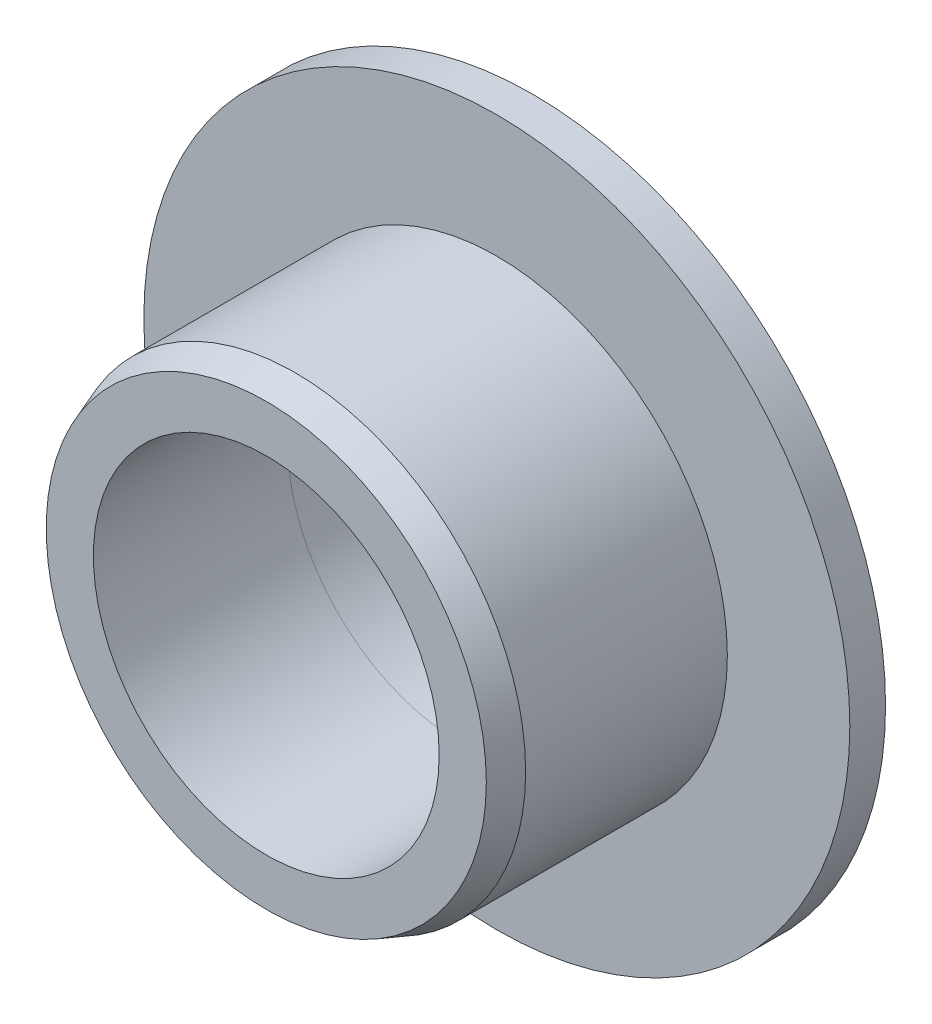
ISO-10303-21;
HEADER;
FILE_DESCRIPTION(('STEP AP214'),'2;1');
FILE_NAME('part.step','',(''),(''),'','','');
FILE_SCHEMA(('AUTOMOTIVE_DESIGN { 1 0 10303 214 1 1 1 1 }'));
ENDSEC;
DATA;
#1=APPLICATION_CONTEXT('core data for automotive mechanical design processes');
#2=APPLICATION_PROTOCOL_DEFINITION('international standard','automotive_design',2000,#1);
#3=PRODUCT_CONTEXT('',#1,'mechanical');
#4=PRODUCT('Part','Part','',(#3));
#5=PRODUCT_RELATED_PRODUCT_CATEGORY('part','',(#4));
#6=PRODUCT_DEFINITION_FORMATION('','',#4);
#7=PRODUCT_DEFINITION_CONTEXT('part definition',#1,'design');
#8=PRODUCT_DEFINITION('design','',#6,#7);
#9=PRODUCT_DEFINITION_SHAPE('','',#8);
#10=(LENGTH_UNIT() NAMED_UNIT(*) SI_UNIT(.MILLI.,.METRE.));
#11=(NAMED_UNIT(*) PLANE_ANGLE_UNIT() SI_UNIT($,.RADIAN.));
#12=(NAMED_UNIT(*) SI_UNIT($,.STERADIAN.) SOLID_ANGLE_UNIT());
#13=UNCERTAINTY_MEASURE_WITH_UNIT(LENGTH_MEASURE(1.E-05),#10,'distance_accuracy_value','');
#14=(GEOMETRIC_REPRESENTATION_CONTEXT(3) GLOBAL_UNCERTAINTY_ASSIGNED_CONTEXT((#13)) GLOBAL_UNIT_ASSIGNED_CONTEXT((#10,
#11,#12)) REPRESENTATION_CONTEXT('',''));
#15=CARTESIAN_POINT('',(0.,0.,0.));
#16=DIRECTION('',(0.,0.,1.));
#17=DIRECTION('',(1.,0.,0.));
#18=AXIS2_PLACEMENT_3D('',#15,#16,#17);
#19=CARTESIAN_POINT('',(-4.44089209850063E-13,2.70616862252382E-13,-2.22044604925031E-13));
#20=DIRECTION('',(0.,0.,1.));
#21=DIRECTION('',(1.,0.,0.));
#22=AXIS2_PLACEMENT_3D('',#19,#20,#21);
#23=CYLINDRICAL_SURFACE('',#22,12.);
#24=CARTESIAN_POINT('',(-1.55431223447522E-12,0.,18.4800000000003));
#25=DIRECTION('',(0.,0.,1.));
#26=DIRECTION('',(1.,0.,0.));
#27=AXIS2_PLACEMENT_3D('',#24,#25,#26);
#28=CIRCLE('',#27,12.);
#29=CARTESIAN_POINT('',(11.9999999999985,0.,18.4800000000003));
#30=VERTEX_POINT('',#29);
#31=EDGE_CURVE('E52',#30,#30,#28,.T.);
#32=ORIENTED_EDGE('',*,*,#31,.T.);
#33=EDGE_LOOP('',(#32));
#34=FACE_BOUND('',#33,.T.);
#35=CARTESIAN_POINT('',(-4.44089209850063E-13,-1.52655665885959E-13,5.00000000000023));
#36=DIRECTION('',(0.,0.,-1.));
#37=DIRECTION('',(-1.,0.,0.));
#38=AXIS2_PLACEMENT_3D('',#35,#36,#37);
#39=CIRCLE('',#38,12.);
#40=CARTESIAN_POINT('',(-12.0000000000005,-1.53488333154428E-13,5.00000000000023));
#41=VERTEX_POINT('',#40);
#42=EDGE_CURVE('E34',#41,#41,#39,.F.);
#43=ORIENTED_EDGE('',*,*,#42,.F.);
#44=EDGE_LOOP('',(#43));
#45=FACE_BOUND('',#44,.T.);
#46=ADVANCED_FACE('F30',(#34,#45),#23,.F.);
#47=CARTESIAN_POINT('',(-4.44089209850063E-13,-1.04083408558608E-13,2.48000000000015));
#48=DIRECTION('',(0.,0.,1.));
#49=DIRECTION('',(1.,0.,0.));
#50=AXIS2_PLACEMENT_3D('',#47,#48,#49);
#51=PLANE('',#50);
#52=CARTESIAN_POINT('',(-4.44089209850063E-13,-1.04083408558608E-13,2.48000000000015));
#53=DIRECTION('',(0.,0.,1.));
#54=DIRECTION('',(1.,0.,0.));
#55=AXIS2_PLACEMENT_3D('',#52,#53,#54);
#56=CIRCLE('',#55,24.5);
#57=CARTESIAN_POINT('',(24.4999999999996,-1.02383379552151E-13,2.48000000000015));
#58=VERTEX_POINT('',#57);
#59=EDGE_CURVE('E64',#58,#58,#56,.T.);
#60=ORIENTED_EDGE('',*,*,#59,.T.);
#61=EDGE_LOOP('',(#60));
#62=FACE_BOUND('',#61,.T.);
#63=CARTESIAN_POINT('',(-4.44089209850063E-13,-1.04083408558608E-13,2.48000000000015));
#64=DIRECTION('',(0.,0.,1.));
#65=DIRECTION('',(1.,0.,0.));
#66=AXIS2_PLACEMENT_3D('',#63,#64,#65);
#67=CIRCLE('',#66,16.);
#68=CARTESIAN_POINT('',(15.9999999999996,-1.02973185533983E-13,2.48000000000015));
#69=VERTEX_POINT('',#68);
#70=EDGE_CURVE('E60',#69,#69,#67,.T.);
#71=ORIENTED_EDGE('',*,*,#70,.F.);
#72=EDGE_LOOP('',(#71));
#73=FACE_BOUND('',#72,.T.);
#74=ADVANCED_FACE('F88',(#62,#73),#51,.T.);
#75=CARTESIAN_POINT('',(-4.44089209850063E-13,-1.04083408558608E-13,2.48000000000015));
#76=DIRECTION('',(0.,0.,-1.));
#77=DIRECTION('',(-1.,0.,0.));
#78=AXIS2_PLACEMENT_3D('',#75,#76,#77);
#79=CYLINDRICAL_SURFACE('',#78,24.5);
#80=ORIENTED_EDGE('',*,*,#59,.F.);
#81=EDGE_LOOP('',(#80));
#82=FACE_BOUND('',#81,.T.);
#83=CARTESIAN_POINT('',(-4.44089209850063E-13,2.70616862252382E-13,-2.22044604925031E-13));
#84=DIRECTION('',(0.,0.,1.));
#85=DIRECTION('',(1.,0.,0.));
#86=AXIS2_PLACEMENT_3D('',#83,#84,#85);
#87=CIRCLE('',#86,24.5);
#88=CARTESIAN_POINT('',(24.4999999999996,2.72316891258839E-13,-2.22044604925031E-13));
#89=VERTEX_POINT('',#88);
#90=EDGE_CURVE('E63',#89,#89,#87,.T.);
#91=ORIENTED_EDGE('',*,*,#90,.T.);
#92=EDGE_LOOP('',(#91));
#93=FACE_BOUND('',#92,.T.);
#94=ADVANCED_FACE('F94',(#82,#93),#79,.T.);
#95=CARTESIAN_POINT('',(-4.44089209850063E-13,2.70616862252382E-13,-2.22044604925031E-13));
#96=DIRECTION('',(0.,0.,1.));
#97=DIRECTION('',(1.,0.,0.));
#98=AXIS2_PLACEMENT_3D('',#95,#96,#97);
#99=PLANE('',#98);
#100=CARTESIAN_POINT('',(-4.44089209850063E-13,2.70616862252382E-13,-2.22044604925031E-13));
#101=DIRECTION('',(0.,0.,1.));
#102=DIRECTION('',(1.,0.,0.));
#103=AXIS2_PLACEMENT_3D('',#100,#101,#102);
#104=CIRCLE('',#103,12.5);
#105=CARTESIAN_POINT('',(12.4999999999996,2.7148422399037E-13,-2.22044604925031E-13));
#106=VERTEX_POINT('',#105);
#107=EDGE_CURVE('E10',#106,#106,#104,.T.);
#108=ORIENTED_EDGE('',*,*,#107,.T.);
#109=EDGE_LOOP('',(#108));
#110=FACE_BOUND('',#109,.T.);
#111=ORIENTED_EDGE('',*,*,#90,.F.);
#112=EDGE_LOOP('',(#111));
#113=FACE_BOUND('',#112,.T.);
#114=ADVANCED_FACE('F103',(#110,#113),#99,.F.);
#115=CARTESIAN_POINT('',(-1.55431223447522E-12,0.,18.4800000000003));
#116=DIRECTION('',(0.,0.,-1.));
#117=DIRECTION('',(-1.,0.,0.));
#118=AXIS2_PLACEMENT_3D('',#115,#116,#117);
#119=CYLINDRICAL_SURFACE('',#118,16.);
#120=CARTESIAN_POINT('',(-6.66133814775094E-13,-1.66533453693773E-13,16.4800000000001));
#121=DIRECTION('',(0.,0.,1.));
#122=DIRECTION('',(1.,0.,0.));
#123=AXIS2_PLACEMENT_3D('',#120,#121,#122);
#124=CIRCLE('',#123,16.);
#125=CARTESIAN_POINT('',(15.9999999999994,-1.65423230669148E-13,16.4800000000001));
#126=VERTEX_POINT('',#125);
#127=EDGE_CURVE('E38',#126,#126,#124,.F.);
#128=ORIENTED_EDGE('',*,*,#127,.T.);
#129=EDGE_LOOP('',(#128));
#130=FACE_BOUND('',#129,.T.);
#131=ORIENTED_EDGE('',*,*,#70,.T.);
#132=EDGE_LOOP('',(#131));
#133=FACE_BOUND('',#132,.T.);
#134=ADVANCED_FACE('F82',(#130,#133),#119,.T.);
#135=CARTESIAN_POINT('',(-1.55431223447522E-12,0.,18.4800000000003));
#136=DIRECTION('',(0.,0.,1.));
#137=DIRECTION('',(1.,0.,0.));
#138=AXIS2_PLACEMENT_3D('',#135,#136,#137);
#139=PLANE('',#138);
#140=ORIENTED_EDGE('',*,*,#31,.F.);
#141=EDGE_LOOP('',(#140));
#142=FACE_BOUND('',#141,.T.);
#143=CARTESIAN_POINT('',(-1.55431223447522E-12,0.,18.4800000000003));
#144=DIRECTION('',(0.,0.,1.));
#145=DIRECTION('',(1.,0.,0.));
#146=AXIS2_PLACEMENT_3D('',#143,#144,#145);
#147=CIRCLE('',#146,15.2720595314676);
#148=CARTESIAN_POINT('',(15.2720595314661,0.,18.4800000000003));
#149=VERTEX_POINT('',#148);
#150=EDGE_CURVE('E43',#149,#149,#147,.T.);
#151=ORIENTED_EDGE('',*,*,#150,.T.);
#152=EDGE_LOOP('',(#151));
#153=FACE_BOUND('',#152,.T.);
#154=ADVANCED_FACE('F71',(#142,#153),#139,.T.);
#155=CARTESIAN_POINT('',(-1.55431223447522E-12,0.,18.4800000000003));
#156=DIRECTION('',(0.,0.,-1.));
#157=DIRECTION('',(-1.,0.,0.));
#158=AXIS2_PLACEMENT_3D('',#155,#156,#157);
#159=CONICAL_SURFACE('',#158,15.2720595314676,0.349065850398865);
#160=ORIENTED_EDGE('',*,*,#127,.F.);
#161=EDGE_LOOP('',(#160));
#162=FACE_BOUND('',#161,.T.);
#163=ORIENTED_EDGE('',*,*,#150,.F.);
#164=EDGE_LOOP('',(#163));
#165=FACE_BOUND('',#164,.T.);
#166=ADVANCED_FACE('F73',(#162,#165),#159,.T.);
#167=CARTESIAN_POINT('',(-4.44089209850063E-13,2.70616862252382E-13,-2.22044604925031E-13));
#168=DIRECTION('',(0.,0.,-1.));
#169=DIRECTION('',(-1.,0.,0.));
#170=AXIS2_PLACEMENT_3D('',#167,#168,#169);
#171=CONICAL_SURFACE('',#170,12.5,0.785398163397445);
#172=CARTESIAN_POINT('',(-1.33226762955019E-12,0.,0.449999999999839));
#173=DIRECTION('',(0.,0.,-1.));
#174=DIRECTION('',(-1.,0.,0.));
#175=AXIS2_PLACEMENT_3D('',#172,#173,#174);
#176=CIRCLE('',#175,12.05);
#177=CARTESIAN_POINT('',(-12.0500000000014,0.,0.449999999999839));
#178=VERTEX_POINT('',#177);
#179=EDGE_CURVE('E46',#178,#178,#176,.T.);
#180=ORIENTED_EDGE('',*,*,#179,.F.);
#181=EDGE_LOOP('',(#180));
#182=FACE_BOUND('',#181,.T.);
#183=ORIENTED_EDGE('',*,*,#107,.F.);
#184=EDGE_LOOP('',(#183));
#185=FACE_BOUND('',#184,.T.);
#186=ADVANCED_FACE('F32',(#182,#185),#171,.F.);
#187=CARTESIAN_POINT('',(-4.44089209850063E-13,-1.52655665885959E-13,5.00000000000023));
#188=DIRECTION('',(0.,0.,-1.));
#189=DIRECTION('',(-1.,0.,0.));
#190=AXIS2_PLACEMENT_3D('',#187,#188,#189);
#191=PLANE('',#190);
#192=CARTESIAN_POINT('',(-4.44089209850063E-13,-1.52655665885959E-13,5.00000000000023));
#193=DIRECTION('',(0.,0.,-1.));
#194=DIRECTION('',(-1.,0.,0.));
#195=AXIS2_PLACEMENT_3D('',#192,#193,#194);
#196=CIRCLE('',#195,12.05);
#197=CARTESIAN_POINT('',(-12.0500000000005,-1.5349180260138E-13,5.00000000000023));
#198=VERTEX_POINT('',#197);
#199=EDGE_CURVE('E48',#198,#198,#196,.T.);
#200=ORIENTED_EDGE('',*,*,#199,.T.);
#201=EDGE_LOOP('',(#200));
#202=FACE_BOUND('',#201,.T.);
#203=ORIENTED_EDGE('',*,*,#42,.T.);
#204=EDGE_LOOP('',(#203));
#205=FACE_BOUND('',#204,.T.);
#206=ADVANCED_FACE('F80',(#202,#205),#191,.T.);
#207=CARTESIAN_POINT('',(-4.44089209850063E-13,-1.52655665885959E-13,5.00000000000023));
#208=DIRECTION('',(0.,0.,-1.));
#209=DIRECTION('',(-1.,0.,0.));
#210=AXIS2_PLACEMENT_3D('',#207,#208,#209);
#211=CYLINDRICAL_SURFACE('',#210,12.05);
#212=ORIENTED_EDGE('',*,*,#179,.T.);
#213=EDGE_LOOP('',(#212));
#214=FACE_BOUND('',#213,.T.);
#215=ORIENTED_EDGE('',*,*,#199,.F.);
#216=EDGE_LOOP('',(#215));
#217=FACE_BOUND('',#216,.T.);
#218=ADVANCED_FACE('F99',(#214,#217),#211,.F.);
#219=CLOSED_SHELL('',(#46,#74,#94,#114,#134,#154,#166,#186,#206,#218));
#220=MANIFOLD_SOLID_BREP('B2',#219);
#221=ADVANCED_BREP_SHAPE_REPRESENTATION('',(#18,#220),#14);
#222=SHAPE_DEFINITION_REPRESENTATION(#9,#221);
ENDSEC;
END-ISO-10303-21;
